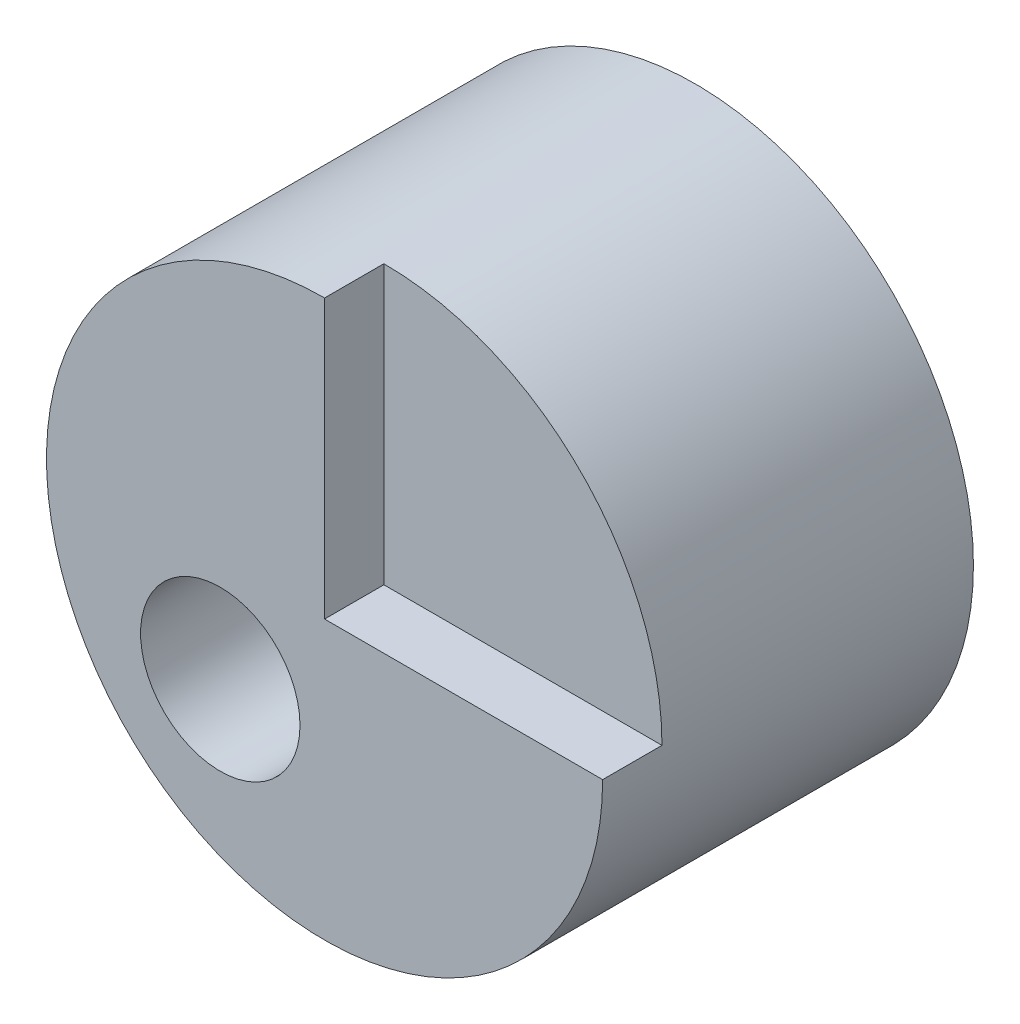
ISO-10303-21;
HEADER;
FILE_DESCRIPTION(('STEP AP214'),'2;1');
FILE_NAME('part.step','',(''),(''),'','','');
FILE_SCHEMA(('AUTOMOTIVE_DESIGN { 1 0 10303 214 1 1 1 1 }'));
ENDSEC;
DATA;
#1=APPLICATION_CONTEXT('core data for automotive mechanical design processes');
#2=APPLICATION_PROTOCOL_DEFINITION('international standard','automotive_design',2000,#1);
#3=PRODUCT_CONTEXT('',#1,'mechanical');
#4=PRODUCT('Part','Part','',(#3));
#5=PRODUCT_RELATED_PRODUCT_CATEGORY('part','',(#4));
#6=PRODUCT_DEFINITION_FORMATION('','',#4);
#7=PRODUCT_DEFINITION_CONTEXT('part definition',#1,'design');
#8=PRODUCT_DEFINITION('design','',#6,#7);
#9=PRODUCT_DEFINITION_SHAPE('','',#8);
#10=(LENGTH_UNIT() NAMED_UNIT(*) SI_UNIT(.MILLI.,.METRE.));
#11=(NAMED_UNIT(*) PLANE_ANGLE_UNIT() SI_UNIT($,.RADIAN.));
#12=(NAMED_UNIT(*) SI_UNIT($,.STERADIAN.) SOLID_ANGLE_UNIT());
#13=UNCERTAINTY_MEASURE_WITH_UNIT(LENGTH_MEASURE(1.E-05),#10,'distance_accuracy_value','');
#14=(GEOMETRIC_REPRESENTATION_CONTEXT(3) GLOBAL_UNCERTAINTY_ASSIGNED_CONTEXT((#13)) GLOBAL_UNIT_ASSIGNED_CONTEXT((#10,
#11,#12)) REPRESENTATION_CONTEXT('',''));
#15=CARTESIAN_POINT('',(0.,0.,0.));
#16=DIRECTION('',(0.,0.,1.));
#17=DIRECTION('',(1.,0.,0.));
#18=AXIS2_PLACEMENT_3D('',#15,#16,#17);
#19=CARTESIAN_POINT('',(-10.63898331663,6.63140362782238,10.));
#20=DIRECTION('',(0.,0.,-1.));
#21=DIRECTION('',(-1.,0.,0.));
#22=AXIS2_PLACEMENT_3D('',#19,#20,#21);
#23=CYLINDRICAL_SURFACE('',#22,7.5);
#24=CARTESIAN_POINT('',(-10.63898331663,6.63140362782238,0.));
#25=DIRECTION('',(0.,0.,1.));
#26=DIRECTION('',(1.,0.,0.));
#27=AXIS2_PLACEMENT_3D('',#24,#25,#26);
#28=CIRCLE('',#27,7.5);
#29=CARTESIAN_POINT('',(-3.13898331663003,6.63140362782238,0.));
#30=VERTEX_POINT('',#29);
#31=EDGE_CURVE('E85',#30,#30,#28,.T.);
#32=ORIENTED_EDGE('',*,*,#31,.T.);
#33=EDGE_LOOP('',(#32));
#34=FACE_BOUND('',#33,.T.);
#35=DIRECTION('',(0.,0.,-1.));
#36=VECTOR('',#35,1.);
#37=CARTESIAN_POINT('',(-3.13898331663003,6.63140362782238,10.));
#38=LINE('',#37,#36);
#39=CARTESIAN_POINT('',(-3.13898331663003,6.63140362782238,10.));
#40=VERTEX_POINT('',#39);
#41=CARTESIAN_POINT('',(-3.13898331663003,6.63140362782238,8.4));
#42=VERTEX_POINT('',#41);
#43=EDGE_CURVE('E56',#40,#42,#38,.T.);
#44=ORIENTED_EDGE('',*,*,#43,.F.);
#45=CARTESIAN_POINT('',(-10.63898331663,6.63140362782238,10.));
#46=DIRECTION('',(0.,0.,1.));
#47=DIRECTION('',(1.,0.,0.));
#48=AXIS2_PLACEMENT_3D('',#45,#46,#47);
#49=CIRCLE('',#48,7.5);
#50=CARTESIAN_POINT('',(-10.63898331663,14.1314036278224,10.));
#51=VERTEX_POINT('',#50);
#52=EDGE_CURVE('E86',#51,#40,#49,.T.);
#53=ORIENTED_EDGE('',*,*,#52,.F.);
#54=DIRECTION('',(0.,0.,-1.));
#55=VECTOR('',#54,1.);
#56=CARTESIAN_POINT('',(-10.63898331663,14.1314036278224,10.));
#57=LINE('',#56,#55);
#58=CARTESIAN_POINT('',(-10.63898331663,14.1314036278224,8.4));
#59=VERTEX_POINT('',#58);
#60=EDGE_CURVE('E48',#51,#59,#57,.T.);
#61=ORIENTED_EDGE('',*,*,#60,.T.);
#62=CARTESIAN_POINT('',(-10.63898331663,6.63140362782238,8.4));
#63=DIRECTION('',(0.,0.,-1.));
#64=DIRECTION('',(-1.,0.,0.));
#65=AXIS2_PLACEMENT_3D('',#62,#63,#64);
#66=CIRCLE('',#65,7.5);
#67=EDGE_CURVE('E12',#59,#42,#66,.T.);
#68=ORIENTED_EDGE('',*,*,#67,.T.);
#69=EDGE_LOOP('',(#44,#53,#61,#68));
#70=FACE_BOUND('',#69,.T.);
#71=ADVANCED_FACE('F34',(#34,#70),#23,.T.);
#72=CARTESIAN_POINT('',(-10.63898331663,6.63140362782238,10.));
#73=DIRECTION('',(0.,0.,1.));
#74=DIRECTION('',(1.,0.,0.));
#75=AXIS2_PLACEMENT_3D('',#72,#73,#74);
#76=PLANE('',#75);
#77=CARTESIAN_POINT('',(-13.45148331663,3.81890362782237,10.));
#78=DIRECTION('',(0.,0.,1.));
#79=DIRECTION('',(1.,0.,0.));
#80=AXIS2_PLACEMENT_3D('',#77,#78,#79);
#81=CIRCLE('',#80,2.15);
#82=CARTESIAN_POINT('',(-11.30148331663,3.81890362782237,10.));
#83=VERTEX_POINT('',#82);
#84=EDGE_CURVE('E126',#83,#83,#81,.T.);
#85=ORIENTED_EDGE('',*,*,#84,.F.);
#86=EDGE_LOOP('',(#85));
#87=FACE_BOUND('',#86,.T.);
#88=ORIENTED_EDGE('',*,*,#52,.T.);
#89=DIRECTION('',(-1.,0.,0.));
#90=VECTOR('',#89,1.);
#91=CARTESIAN_POINT('',(-10.63898331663,6.63140362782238,10.));
#92=LINE('',#91,#90);
#93=CARTESIAN_POINT('',(-10.63898331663,6.63140362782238,10.));
#94=VERTEX_POINT('',#93);
#95=EDGE_CURVE('E41',#40,#94,#92,.T.);
#96=ORIENTED_EDGE('',*,*,#95,.T.);
#97=DIRECTION('',(0.,-1.,0.));
#98=VECTOR('',#97,1.);
#99=CARTESIAN_POINT('',(-10.63898331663,6.63140362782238,10.));
#100=LINE('',#99,#98);
#101=EDGE_CURVE('E80',#51,#94,#100,.T.);
#102=ORIENTED_EDGE('',*,*,#101,.F.);
#103=EDGE_LOOP('',(#88,#96,#102));
#104=FACE_BOUND('',#103,.T.);
#105=ADVANCED_FACE('F92',(#87,#104),#76,.T.);
#106=CARTESIAN_POINT('',(-10.63898331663,6.63140362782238,0.));
#107=DIRECTION('',(0.,0.,1.));
#108=DIRECTION('',(1.,0.,0.));
#109=AXIS2_PLACEMENT_3D('',#106,#107,#108);
#110=PLANE('',#109);
#111=CARTESIAN_POINT('',(-13.45148331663,3.81890362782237,0.));
#112=DIRECTION('',(0.,0.,1.));
#113=DIRECTION('',(1.,0.,0.));
#114=AXIS2_PLACEMENT_3D('',#111,#112,#113);
#115=CIRCLE('',#114,2.15);
#116=CARTESIAN_POINT('',(-11.30148331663,3.81890362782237,0.));
#117=VERTEX_POINT('',#116);
#118=EDGE_CURVE('E75',#117,#117,#115,.T.);
#119=ORIENTED_EDGE('',*,*,#118,.T.);
#120=EDGE_LOOP('',(#119));
#121=FACE_BOUND('',#120,.T.);
#122=ORIENTED_EDGE('',*,*,#31,.F.);
#123=EDGE_LOOP('',(#122));
#124=FACE_BOUND('',#123,.T.);
#125=ADVANCED_FACE('F100',(#121,#124),#110,.F.);
#126=CARTESIAN_POINT('',(0.,0.,8.4));
#127=DIRECTION('',(0.,0.,-1.));
#128=DIRECTION('',(-1.,0.,0.));
#129=AXIS2_PLACEMENT_3D('',#126,#127,#128);
#130=PLANE('',#129);
#131=DIRECTION('',(0.,-1.,0.));
#132=VECTOR('',#131,1.);
#133=CARTESIAN_POINT('',(-10.63898331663,16.105742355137,8.4));
#134=LINE('',#133,#132);
#135=CARTESIAN_POINT('',(-10.63898331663,6.63140362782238,8.4));
#136=VERTEX_POINT('',#135);
#137=EDGE_CURVE('E74',#59,#136,#134,.T.);
#138=ORIENTED_EDGE('',*,*,#137,.T.);
#139=DIRECTION('',(-1.,0.,0.));
#140=VECTOR('',#139,1.);
#141=CARTESIAN_POINT('',(-1.94691100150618,6.63140362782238,8.4));
#142=LINE('',#141,#140);
#143=EDGE_CURVE('E67',#42,#136,#142,.T.);
#144=ORIENTED_EDGE('',*,*,#143,.F.);
#145=ORIENTED_EDGE('',*,*,#67,.F.);
#146=EDGE_LOOP('',(#138,#144,#145));
#147=FACE_BOUND('',#146,.T.);
#148=ADVANCED_FACE('F77',(#147),#130,.F.);
#149=CARTESIAN_POINT('',(-1.94691100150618,6.63140362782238,8.4));
#150=DIRECTION('',(0.,1.,0.));
#151=DIRECTION('',(0.,0.,1.));
#152=AXIS2_PLACEMENT_3D('',#149,#150,#151);
#153=PLANE('',#152);
#154=ORIENTED_EDGE('',*,*,#43,.T.);
#155=ORIENTED_EDGE('',*,*,#143,.T.);
#156=DIRECTION('',(0.,0.,1.));
#157=VECTOR('',#156,1.);
#158=CARTESIAN_POINT('',(-10.63898331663,6.63140362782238,8.4));
#159=LINE('',#158,#157);
#160=EDGE_CURVE('E71',#136,#94,#159,.T.);
#161=ORIENTED_EDGE('',*,*,#160,.T.);
#162=ORIENTED_EDGE('',*,*,#95,.F.);
#163=EDGE_LOOP('',(#154,#155,#161,#162));
#164=FACE_BOUND('',#163,.T.);
#165=ADVANCED_FACE('F69',(#164),#153,.T.);
#166=CARTESIAN_POINT('',(-10.63898331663,16.105742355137,8.4));
#167=DIRECTION('',(-1.,0.,0.));
#168=DIRECTION('',(0.,0.,1.));
#169=AXIS2_PLACEMENT_3D('',#166,#167,#168);
#170=PLANE('',#169);
#171=ORIENTED_EDGE('',*,*,#101,.T.);
#172=ORIENTED_EDGE('',*,*,#160,.F.);
#173=ORIENTED_EDGE('',*,*,#137,.F.);
#174=ORIENTED_EDGE('',*,*,#60,.F.);
#175=EDGE_LOOP('',(#171,#172,#173,#174));
#176=FACE_BOUND('',#175,.T.);
#177=ADVANCED_FACE('F79',(#176),#170,.F.);
#178=CARTESIAN_POINT('',(-13.45148331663,3.81890362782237,0.));
#179=DIRECTION('',(0.,0.,1.));
#180=DIRECTION('',(1.,0.,0.));
#181=AXIS2_PLACEMENT_3D('',#178,#179,#180);
#182=CYLINDRICAL_SURFACE('',#181,2.15);
#183=ORIENTED_EDGE('',*,*,#118,.F.);
#184=EDGE_LOOP('',(#183));
#185=FACE_BOUND('',#184,.T.);
#186=ORIENTED_EDGE('',*,*,#84,.T.);
#187=EDGE_LOOP('',(#186));
#188=FACE_BOUND('',#187,.T.);
#189=ADVANCED_FACE('F116',(#185,#188),#182,.F.);
#190=CLOSED_SHELL('',(#71,#105,#125,#148,#165,#177,#189));
#191=MANIFOLD_SOLID_BREP('B2',#190);
#192=ADVANCED_BREP_SHAPE_REPRESENTATION('',(#18,#191),#14);
#193=SHAPE_DEFINITION_REPRESENTATION(#9,#192);
ENDSEC;
END-ISO-10303-21;
